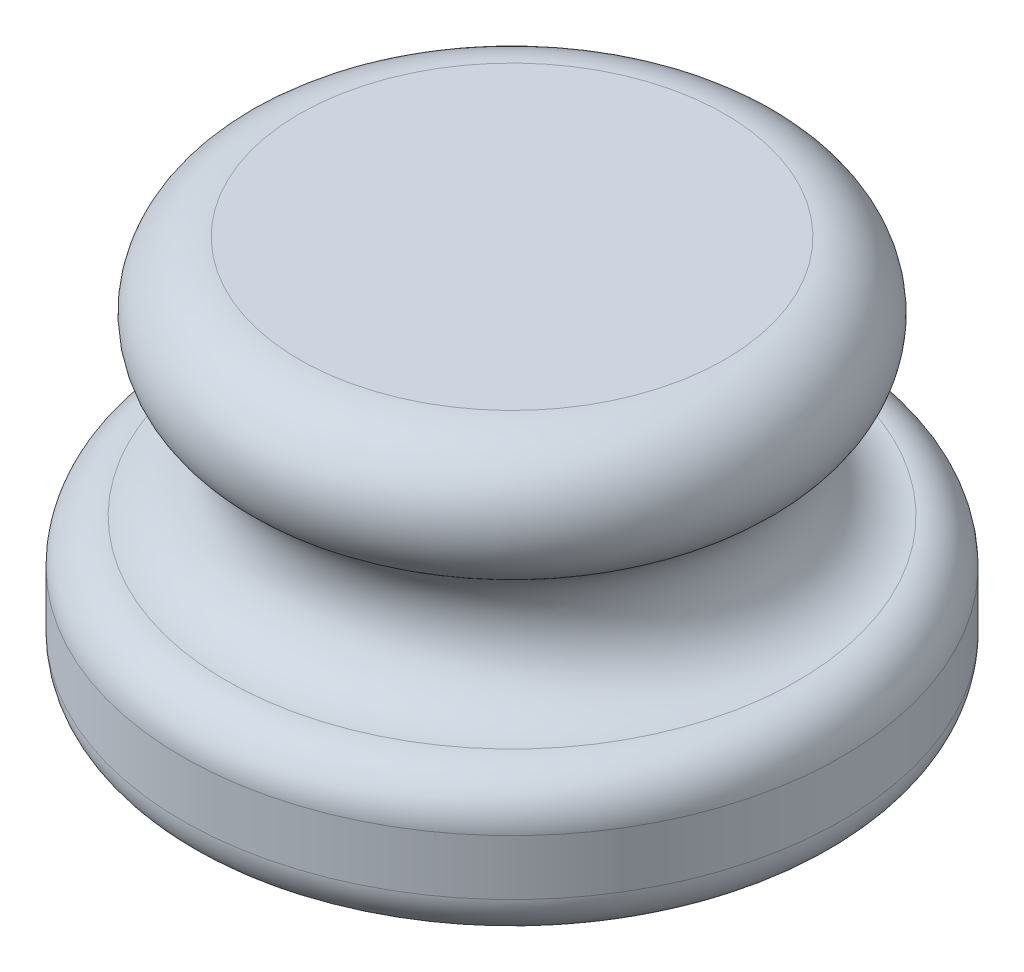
ISO-10303-21;
HEADER;
FILE_DESCRIPTION(('STEP AP214'),'2;1');
FILE_NAME('part.step','',(''),(''),'','','');
FILE_SCHEMA(('AUTOMOTIVE_DESIGN { 1 0 10303 214 1 1 1 1 }'));
ENDSEC;
DATA;
#1=APPLICATION_CONTEXT('core data for automotive mechanical design processes');
#2=APPLICATION_PROTOCOL_DEFINITION('international standard','automotive_design',2000,#1);
#3=PRODUCT_CONTEXT('',#1,'mechanical');
#4=PRODUCT('Part','Part','',(#3));
#5=PRODUCT_RELATED_PRODUCT_CATEGORY('part','',(#4));
#6=PRODUCT_DEFINITION_FORMATION('','',#4);
#7=PRODUCT_DEFINITION_CONTEXT('part definition',#1,'design');
#8=PRODUCT_DEFINITION('design','',#6,#7);
#9=PRODUCT_DEFINITION_SHAPE('','',#8);
#10=(LENGTH_UNIT() NAMED_UNIT(*) SI_UNIT(.MILLI.,.METRE.));
#11=(NAMED_UNIT(*) PLANE_ANGLE_UNIT() SI_UNIT($,.RADIAN.));
#12=(NAMED_UNIT(*) SI_UNIT($,.STERADIAN.) SOLID_ANGLE_UNIT());
#13=UNCERTAINTY_MEASURE_WITH_UNIT(LENGTH_MEASURE(1.E-05),#10,'distance_accuracy_value','');
#14=(GEOMETRIC_REPRESENTATION_CONTEXT(3) GLOBAL_UNCERTAINTY_ASSIGNED_CONTEXT((#13)) GLOBAL_UNIT_ASSIGNED_CONTEXT((#10,
#11,#12)) REPRESENTATION_CONTEXT('',''));
#15=CARTESIAN_POINT('',(0.,0.,0.));
#16=DIRECTION('',(0.,0.,1.));
#17=DIRECTION('',(1.,0.,0.));
#18=AXIS2_PLACEMENT_3D('',#15,#16,#17);
#19=CARTESIAN_POINT('',(0.,0.,0.));
#20=DIRECTION('',(0.,-1.,0.));
#21=DIRECTION('',(1.,0.,0.));
#22=AXIS2_PLACEMENT_3D('',#19,#20,#21);
#23=PLANE('',#22);
#24=CARTESIAN_POINT('',(0.,0.,0.));
#25=DIRECTION('',(0.,1.,0.));
#26=DIRECTION('',(-1.,0.,0.));
#27=AXIS2_PLACEMENT_3D('',#24,#25,#26);
#28=CIRCLE('',#27,13.);
#29=CARTESIAN_POINT('',(-13.,0.,0.));
#30=VERTEX_POINT('',#29);
#31=EDGE_CURVE('E10',#30,#30,#28,.T.);
#32=ORIENTED_EDGE('',*,*,#31,.F.);
#33=EDGE_LOOP('',(#32));
#34=FACE_BOUND('',#33,.T.);
#35=ADVANCED_FACE('F37',(#34),#23,.T.);
#36=CARTESIAN_POINT('',(0.,2.,0.));
#37=DIRECTION('',(0.,1.,0.));
#38=DIRECTION('',(-1.,0.,0.));
#39=AXIS2_PLACEMENT_3D('',#36,#37,#38);
#40=TOROIDAL_SURFACE('',#39,13.,2.);
#41=ORIENTED_EDGE('',*,*,#31,.T.);
#42=EDGE_LOOP('',(#41));
#43=FACE_BOUND('',#42,.T.);
#44=CARTESIAN_POINT('',(0.,2.,0.));
#45=DIRECTION('',(0.,1.,0.));
#46=DIRECTION('',(-1.,0.,0.));
#47=AXIS2_PLACEMENT_3D('',#44,#45,#46);
#48=CIRCLE('',#47,15.);
#49=CARTESIAN_POINT('',(-15.,2.,0.));
#50=VERTEX_POINT('',#49);
#51=EDGE_CURVE('E43',#50,#50,#48,.T.);
#52=ORIENTED_EDGE('',*,*,#51,.F.);
#53=EDGE_LOOP('',(#52));
#54=FACE_BOUND('',#53,.T.);
#55=ADVANCED_FACE('F79',(#43,#54),#40,.T.);
#56=CARTESIAN_POINT('',(0.,17.52,0.));
#57=DIRECTION('',(0.,1.,0.));
#58=DIRECTION('',(-1.,0.,0.));
#59=AXIS2_PLACEMENT_3D('',#56,#57,#58);
#60=CYLINDRICAL_SURFACE('',#59,15.);
#61=ORIENTED_EDGE('',*,*,#51,.T.);
#62=EDGE_LOOP('',(#61));
#63=FACE_BOUND('',#62,.T.);
#64=CARTESIAN_POINT('',(0.,4.52,0.));
#65=DIRECTION('',(0.,1.,0.));
#66=DIRECTION('',(-1.,0.,0.));
#67=AXIS2_PLACEMENT_3D('',#64,#65,#66);
#68=CIRCLE('',#67,15.);
#69=CARTESIAN_POINT('',(-15.,4.52,0.));
#70=VERTEX_POINT('',#69);
#71=EDGE_CURVE('E47',#70,#70,#68,.T.);
#72=ORIENTED_EDGE('',*,*,#71,.F.);
#73=EDGE_LOOP('',(#72));
#74=FACE_BOUND('',#73,.T.);
#75=ADVANCED_FACE('F84',(#63,#74),#60,.T.);
#76=CARTESIAN_POINT('',(0.,4.52,0.));
#77=DIRECTION('',(0.,1.,0.));
#78=DIRECTION('',(-1.,0.,0.));
#79=AXIS2_PLACEMENT_3D('',#76,#77,#78);
#80=TOROIDAL_SURFACE('',#79,13.,2.);
#81=ORIENTED_EDGE('',*,*,#71,.T.);
#82=EDGE_LOOP('',(#81));
#83=FACE_BOUND('',#82,.T.);
#84=CARTESIAN_POINT('',(0.,6.52,0.));
#85=DIRECTION('',(0.,1.,0.));
#86=DIRECTION('',(-1.,0.,0.));
#87=AXIS2_PLACEMENT_3D('',#84,#85,#86);
#88=CIRCLE('',#87,13.);
#89=CARTESIAN_POINT('',(-13.,6.52,0.));
#90=VERTEX_POINT('',#89);
#91=EDGE_CURVE('E51',#90,#90,#88,.T.);
#92=ORIENTED_EDGE('',*,*,#91,.F.);
#93=EDGE_LOOP('',(#92));
#94=FACE_BOUND('',#93,.T.);
#95=ADVANCED_FACE('F75',(#83,#94),#80,.T.);
#96=CARTESIAN_POINT('',(0.,9.51999999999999,0.));
#97=DIRECTION('',(0.,1.,0.));
#98=DIRECTION('',(-1.,0.,0.));
#99=AXIS2_PLACEMENT_3D('',#96,#97,#98);
#100=TOROIDAL_SURFACE('',#99,13.,2.99999999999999);
#101=ORIENTED_EDGE('',*,*,#91,.T.);
#102=EDGE_LOOP('',(#101));
#103=FACE_BOUND('',#102,.T.);
#104=CARTESIAN_POINT('',(0.,12.02,0.));
#105=DIRECTION('',(0.,1.,0.));
#106=DIRECTION('',(-1.,0.,0.));
#107=AXIS2_PLACEMENT_3D('',#104,#105,#106);
#108=CIRCLE('',#107,11.3416876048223);
#109=CARTESIAN_POINT('',(-11.3416876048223,12.02,0.));
#110=VERTEX_POINT('',#109);
#111=EDGE_CURVE('E56',#110,#110,#108,.T.);
#112=ORIENTED_EDGE('',*,*,#111,.F.);
#113=EDGE_LOOP('',(#112));
#114=FACE_BOUND('',#113,.T.);
#115=ADVANCED_FACE('F67',(#103,#114),#100,.F.);
#116=CARTESIAN_POINT('',(0.,14.52,0.));
#117=DIRECTION('',(0.,1.,0.));
#118=DIRECTION('',(-1.,0.,0.));
#119=AXIS2_PLACEMENT_3D('',#116,#117,#118);
#120=TOROIDAL_SURFACE('',#119,9.6833752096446,3.);
#121=ORIENTED_EDGE('',*,*,#111,.T.);
#122=EDGE_LOOP('',(#121));
#123=FACE_BOUND('',#122,.T.);
#124=CARTESIAN_POINT('',(0.,17.52,0.));
#125=DIRECTION('',(0.,1.,0.));
#126=DIRECTION('',(-1.,0.,0.));
#127=AXIS2_PLACEMENT_3D('',#124,#125,#126);
#128=CIRCLE('',#127,9.6833752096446);
#129=CARTESIAN_POINT('',(-9.6833752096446,17.52,0.));
#130=VERTEX_POINT('',#129);
#131=EDGE_CURVE('E59',#130,#130,#128,.T.);
#132=ORIENTED_EDGE('',*,*,#131,.F.);
#133=EDGE_LOOP('',(#132));
#134=FACE_BOUND('',#133,.T.);
#135=ADVANCED_FACE('F65',(#123,#134),#120,.T.);
#136=CARTESIAN_POINT('',(-9.6833752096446,17.52,0.));
#137=DIRECTION('',(0.,1.,0.));
#138=DIRECTION('',(-1.,0.,0.));
#139=AXIS2_PLACEMENT_3D('',#136,#137,#138);
#140=PLANE('',#139);
#141=ORIENTED_EDGE('',*,*,#131,.T.);
#142=EDGE_LOOP('',(#141));
#143=FACE_BOUND('',#142,.T.);
#144=ADVANCED_FACE('F63',(#143),#140,.T.);
#145=CLOSED_SHELL('',(#35,#55,#75,#95,#115,#135,#144));
#146=MANIFOLD_SOLID_BREP('B2',#145);
#147=ADVANCED_BREP_SHAPE_REPRESENTATION('',(#18,#146),#14);
#148=SHAPE_DEFINITION_REPRESENTATION(#9,#147);
ENDSEC;
END-ISO-10303-21;
